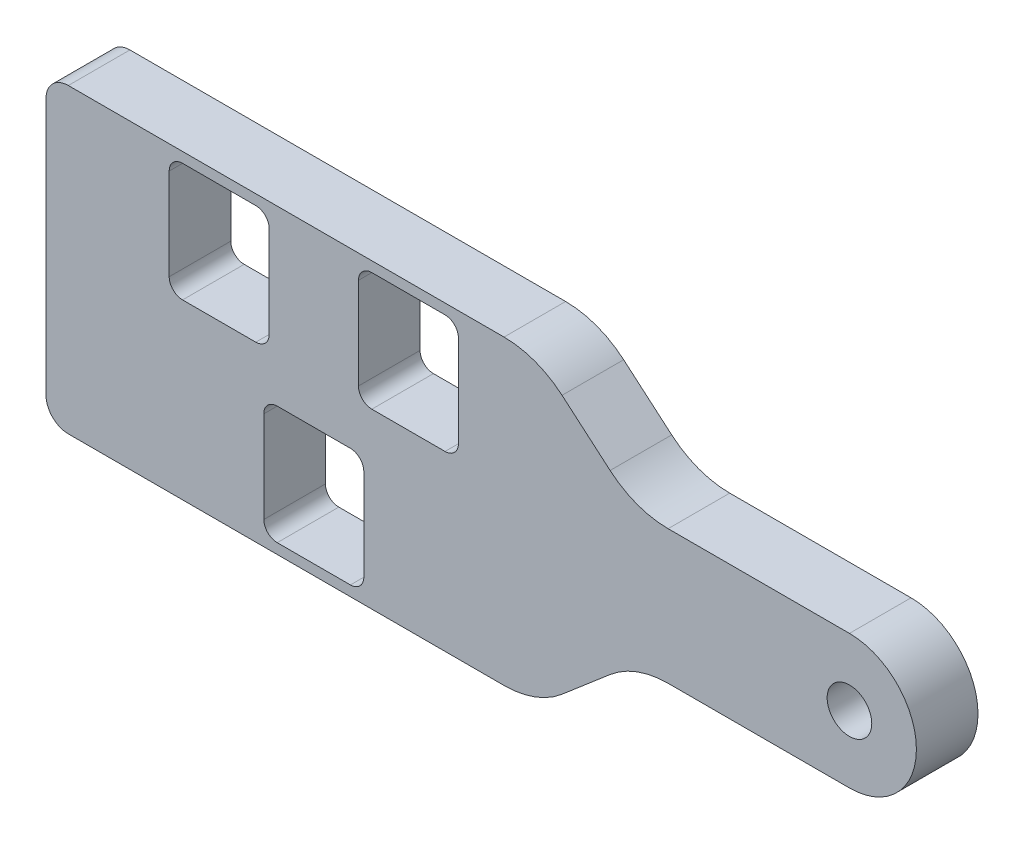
ISO-10303-21;
HEADER;
FILE_DESCRIPTION(('STEP AP214'),'2;1');
FILE_NAME('part.step','',(''),(''),'','','');
FILE_SCHEMA(('AUTOMOTIVE_DESIGN { 1 0 10303 214 1 1 1 1 }'));
ENDSEC;
DATA;
#1=APPLICATION_CONTEXT('core data for automotive mechanical design processes');
#2=APPLICATION_PROTOCOL_DEFINITION('international standard','automotive_design',2000,#1);
#3=PRODUCT_CONTEXT('',#1,'mechanical');
#4=PRODUCT('Part','Part','',(#3));
#5=PRODUCT_RELATED_PRODUCT_CATEGORY('part','',(#4));
#6=PRODUCT_DEFINITION_FORMATION('','',#4);
#7=PRODUCT_DEFINITION_CONTEXT('part definition',#1,'design');
#8=PRODUCT_DEFINITION('design','',#6,#7);
#9=PRODUCT_DEFINITION_SHAPE('','',#8);
#10=(LENGTH_UNIT() NAMED_UNIT(*) SI_UNIT(.MILLI.,.METRE.));
#11=(NAMED_UNIT(*) PLANE_ANGLE_UNIT() SI_UNIT($,.RADIAN.));
#12=(NAMED_UNIT(*) SI_UNIT($,.STERADIAN.) SOLID_ANGLE_UNIT());
#13=UNCERTAINTY_MEASURE_WITH_UNIT(LENGTH_MEASURE(1.E-05),#10,'distance_accuracy_value','');
#14=(GEOMETRIC_REPRESENTATION_CONTEXT(3) GLOBAL_UNCERTAINTY_ASSIGNED_CONTEXT((#13)) GLOBAL_UNIT_ASSIGNED_CONTEXT((#10,
#11,#12)) REPRESENTATION_CONTEXT('',''));
#15=CARTESIAN_POINT('',(0.,0.,0.));
#16=DIRECTION('',(0.,0.,1.));
#17=DIRECTION('',(1.,0.,0.));
#18=AXIS2_PLACEMENT_3D('',#15,#16,#17);
#19=CARTESIAN_POINT('',(88.502778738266,-0.762000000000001,8.763));
#20=DIRECTION('',(0.,0.,1.));
#21=DIRECTION('',(1.,0.,0.));
#22=AXIS2_PLACEMENT_3D('',#19,#20,#21);
#23=PLANE('',#22);
#24=CARTESIAN_POINT('',(19.431,39.5605000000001,8.763));
#25=DIRECTION('',(0.,0.,1.));
#26=DIRECTION('',(1.,0.,0.));
#27=AXIS2_PLACEMENT_3D('',#24,#25,#26);
#28=CIRCLE('',#27,1.905);
#29=CARTESIAN_POINT('',(19.431,41.4655000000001,8.763));
#30=VERTEX_POINT('',#29);
#31=CARTESIAN_POINT('',(17.526,39.5605000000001,8.763));
#32=VERTEX_POINT('',#31);
#33=EDGE_CURVE('E47',#30,#32,#28,.T.);
#34=ORIENTED_EDGE('',*,*,#33,.F.);
#35=DIRECTION('',(-1.,0.,0.));
#36=VECTOR('',#35,1.);
#37=CARTESIAN_POINT('',(29.845,41.4655000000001,8.763));
#38=LINE('',#37,#36);
#39=CARTESIAN_POINT('',(29.845,41.4655000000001,8.763));
#40=VERTEX_POINT('',#39);
#41=EDGE_CURVE('E296',#40,#30,#38,.T.);
#42=ORIENTED_EDGE('',*,*,#41,.F.);
#43=CARTESIAN_POINT('',(29.845,39.5605000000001,8.763));
#44=DIRECTION('',(0.,0.,1.));
#45=DIRECTION('',(-1.,0.,0.));
#46=AXIS2_PLACEMENT_3D('',#43,#44,#45);
#47=CIRCLE('',#46,1.905);
#48=CARTESIAN_POINT('',(31.75,39.5605000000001,8.763));
#49=VERTEX_POINT('',#48);
#50=EDGE_CURVE('E299',#49,#40,#47,.T.);
#51=ORIENTED_EDGE('',*,*,#50,.F.);
#52=DIRECTION('',(0.,1.,0.));
#53=VECTOR('',#52,1.);
#54=CARTESIAN_POINT('',(31.75,39.5605000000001,8.763));
#55=LINE('',#54,#53);
#56=CARTESIAN_POINT('',(31.75,26.543,8.763));
#57=VERTEX_POINT('',#56);
#58=EDGE_CURVE('E327',#57,#49,#55,.T.);
#59=ORIENTED_EDGE('',*,*,#58,.F.);
#60=CARTESIAN_POINT('',(29.845,26.543,8.763));
#61=DIRECTION('',(0.,0.,1.));
#62=DIRECTION('',(-1.,0.,0.));
#63=AXIS2_PLACEMENT_3D('',#60,#61,#62);
#64=CIRCLE('',#63,1.905);
#65=CARTESIAN_POINT('',(29.845,24.638,8.763));
#66=VERTEX_POINT('',#65);
#67=EDGE_CURVE('E324',#66,#57,#64,.T.);
#68=ORIENTED_EDGE('',*,*,#67,.F.);
#69=DIRECTION('',(1.,0.,0.));
#70=VECTOR('',#69,1.);
#71=CARTESIAN_POINT('',(29.845,24.638,8.763));
#72=LINE('',#71,#70);
#73=CARTESIAN_POINT('',(19.431,24.638,8.763));
#74=VERTEX_POINT('',#73);
#75=EDGE_CURVE('E321',#74,#66,#72,.T.);
#76=ORIENTED_EDGE('',*,*,#75,.F.);
#77=CARTESIAN_POINT('',(19.431,26.543,8.763));
#78=DIRECTION('',(0.,0.,1.));
#79=DIRECTION('',(-1.,0.,0.));
#80=AXIS2_PLACEMENT_3D('',#77,#78,#79);
#81=CIRCLE('',#80,1.905);
#82=CARTESIAN_POINT('',(17.526,26.543,8.763));
#83=VERTEX_POINT('',#82);
#84=EDGE_CURVE('E318',#83,#74,#81,.T.);
#85=ORIENTED_EDGE('',*,*,#84,.F.);
#86=DIRECTION('',(0.,-1.,0.));
#87=VECTOR('',#86,1.);
#88=CARTESIAN_POINT('',(17.526,39.5605000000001,8.763));
#89=LINE('',#88,#87);
#90=EDGE_CURVE('E316',#32,#83,#89,.T.);
#91=ORIENTED_EDGE('',*,*,#90,.F.);
#92=EDGE_LOOP('',(#34,#42,#51,#59,#68,#76,#85,#91));
#93=FACE_BOUND('',#92,.T.);
#94=CARTESIAN_POINT('',(46.355,39.5605000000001,8.763));
#95=DIRECTION('',(0.,0.,1.));
#96=DIRECTION('',(1.,0.,0.));
#97=AXIS2_PLACEMENT_3D('',#94,#95,#96);
#98=CIRCLE('',#97,1.905);
#99=CARTESIAN_POINT('',(46.355,41.4655000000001,8.763));
#100=VERTEX_POINT('',#99);
#101=CARTESIAN_POINT('',(44.45,39.5605000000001,8.763));
#102=VERTEX_POINT('',#101);
#103=EDGE_CURVE('E334',#100,#102,#98,.T.);
#104=ORIENTED_EDGE('',*,*,#103,.F.);
#105=DIRECTION('',(-1.,0.,0.));
#106=VECTOR('',#105,1.);
#107=CARTESIAN_POINT('',(46.355,41.4655000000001,8.763));
#108=LINE('',#107,#106);
#109=CARTESIAN_POINT('',(56.769,41.4655000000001,8.763));
#110=VERTEX_POINT('',#109);
#111=EDGE_CURVE('E350',#110,#100,#108,.T.);
#112=ORIENTED_EDGE('',*,*,#111,.F.);
#113=CARTESIAN_POINT('',(56.769,39.5605000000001,8.763));
#114=DIRECTION('',(0.,0.,1.));
#115=DIRECTION('',(-1.,0.,0.));
#116=AXIS2_PLACEMENT_3D('',#113,#114,#115);
#117=CIRCLE('',#116,1.905);
#118=CARTESIAN_POINT('',(58.674,39.5605000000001,8.763));
#119=VERTEX_POINT('',#118);
#120=EDGE_CURVE('E388',#119,#110,#117,.T.);
#121=ORIENTED_EDGE('',*,*,#120,.F.);
#122=DIRECTION('',(0.,1.,0.));
#123=VECTOR('',#122,1.);
#124=CARTESIAN_POINT('',(58.674,39.5605000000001,8.763));
#125=LINE('',#124,#123);
#126=CARTESIAN_POINT('',(58.674,26.543,8.763));
#127=VERTEX_POINT('',#126);
#128=EDGE_CURVE('E385',#127,#119,#125,.T.);
#129=ORIENTED_EDGE('',*,*,#128,.F.);
#130=CARTESIAN_POINT('',(56.769,26.543,8.763));
#131=DIRECTION('',(0.,0.,1.));
#132=DIRECTION('',(1.,0.,0.));
#133=AXIS2_PLACEMENT_3D('',#130,#131,#132);
#134=CIRCLE('',#133,1.905);
#135=CARTESIAN_POINT('',(56.769,24.638,8.763));
#136=VERTEX_POINT('',#135);
#137=EDGE_CURVE('E382',#136,#127,#134,.T.);
#138=ORIENTED_EDGE('',*,*,#137,.F.);
#139=DIRECTION('',(1.,0.,0.));
#140=VECTOR('',#139,1.);
#141=CARTESIAN_POINT('',(46.355,24.638,8.763));
#142=LINE('',#141,#140);
#143=CARTESIAN_POINT('',(46.355,24.638,8.763));
#144=VERTEX_POINT('',#143);
#145=EDGE_CURVE('E379',#144,#136,#142,.T.);
#146=ORIENTED_EDGE('',*,*,#145,.F.);
#147=CARTESIAN_POINT('',(46.355,26.543,8.763));
#148=DIRECTION('',(0.,0.,1.));
#149=DIRECTION('',(1.,0.,0.));
#150=AXIS2_PLACEMENT_3D('',#147,#148,#149);
#151=CIRCLE('',#150,1.905);
#152=CARTESIAN_POINT('',(44.45,26.543,8.763));
#153=VERTEX_POINT('',#152);
#154=EDGE_CURVE('E376',#153,#144,#151,.T.);
#155=ORIENTED_EDGE('',*,*,#154,.F.);
#156=DIRECTION('',(0.,-1.,0.));
#157=VECTOR('',#156,1.);
#158=CARTESIAN_POINT('',(44.45,39.5605000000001,8.763));
#159=LINE('',#158,#157);
#160=EDGE_CURVE('E373',#102,#153,#159,.T.);
#161=ORIENTED_EDGE('',*,*,#160,.F.);
#162=EDGE_LOOP('',(#104,#112,#121,#129,#138,#146,#155,#161));
#163=FACE_BOUND('',#162,.T.);
#164=CARTESIAN_POINT('',(32.8929999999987,16.383,8.763));
#165=DIRECTION('',(0.,0.,1.));
#166=DIRECTION('',(1.,0.,0.));
#167=AXIS2_PLACEMENT_3D('',#164,#165,#166);
#168=CIRCLE('',#167,1.905);
#169=CARTESIAN_POINT('',(32.8929999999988,18.288,8.763));
#170=VERTEX_POINT('',#169);
#171=CARTESIAN_POINT('',(30.9879999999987,16.383,8.763));
#172=VERTEX_POINT('',#171);
#173=EDGE_CURVE('E395',#170,#172,#168,.T.);
#174=ORIENTED_EDGE('',*,*,#173,.F.);
#175=DIRECTION('',(-1.,0.,0.));
#176=VECTOR('',#175,1.);
#177=CARTESIAN_POINT('',(32.8929999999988,18.288,8.763));
#178=LINE('',#177,#176);
#179=CARTESIAN_POINT('',(43.3070000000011,18.288,8.763));
#180=VERTEX_POINT('',#179);
#181=EDGE_CURVE('E414',#180,#170,#178,.T.);
#182=ORIENTED_EDGE('',*,*,#181,.F.);
#183=CARTESIAN_POINT('',(43.3070000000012,16.383,8.763));
#184=DIRECTION('',(0.,0.,1.));
#185=DIRECTION('',(-1.,0.,0.));
#186=AXIS2_PLACEMENT_3D('',#183,#184,#185);
#187=CIRCLE('',#186,1.905);
#188=CARTESIAN_POINT('',(45.2120000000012,16.383,8.763));
#189=VERTEX_POINT('',#188);
#190=EDGE_CURVE('E452',#189,#180,#187,.T.);
#191=ORIENTED_EDGE('',*,*,#190,.F.);
#192=DIRECTION('',(0.,1.,0.));
#193=VECTOR('',#192,1.);
#194=CARTESIAN_POINT('',(45.2120000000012,16.383,8.763));
#195=LINE('',#194,#193);
#196=CARTESIAN_POINT('',(45.2120000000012,3.36549999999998,8.763));
#197=VERTEX_POINT('',#196);
#198=EDGE_CURVE('E449',#197,#189,#195,.T.);
#199=ORIENTED_EDGE('',*,*,#198,.F.);
#200=CARTESIAN_POINT('',(43.3070000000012,3.36549999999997,8.763));
#201=DIRECTION('',(0.,0.,1.));
#202=DIRECTION('',(1.,0.,0.));
#203=AXIS2_PLACEMENT_3D('',#200,#201,#202);
#204=CIRCLE('',#203,1.905);
#205=CARTESIAN_POINT('',(43.3070000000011,1.46049999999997,8.763));
#206=VERTEX_POINT('',#205);
#207=EDGE_CURVE('E446',#206,#197,#204,.T.);
#208=ORIENTED_EDGE('',*,*,#207,.F.);
#209=DIRECTION('',(1.,0.,0.));
#210=VECTOR('',#209,1.);
#211=CARTESIAN_POINT('',(32.8929999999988,1.46049999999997,8.763));
#212=LINE('',#211,#210);
#213=CARTESIAN_POINT('',(32.8929999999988,1.46049999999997,8.763));
#214=VERTEX_POINT('',#213);
#215=EDGE_CURVE('E443',#214,#206,#212,.T.);
#216=ORIENTED_EDGE('',*,*,#215,.F.);
#217=CARTESIAN_POINT('',(32.8929999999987,3.36549999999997,8.763));
#218=DIRECTION('',(0.,0.,1.));
#219=DIRECTION('',(1.,0.,0.));
#220=AXIS2_PLACEMENT_3D('',#217,#218,#219);
#221=CIRCLE('',#220,1.905);
#222=CARTESIAN_POINT('',(30.9879999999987,3.36549999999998,8.763));
#223=VERTEX_POINT('',#222);
#224=EDGE_CURVE('E440',#223,#214,#221,.T.);
#225=ORIENTED_EDGE('',*,*,#224,.F.);
#226=DIRECTION('',(0.,-1.,0.));
#227=VECTOR('',#226,1.);
#228=CARTESIAN_POINT('',(30.9879999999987,16.383,8.763));
#229=LINE('',#228,#227);
#230=EDGE_CURVE('E437',#172,#223,#229,.T.);
#231=ORIENTED_EDGE('',*,*,#230,.F.);
#232=EDGE_LOOP('',(#174,#182,#191,#199,#208,#216,#225,#231));
#233=FACE_BOUND('',#232,.T.);
#234=CARTESIAN_POINT('',(88.502778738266,-0.762000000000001,8.763));
#235=DIRECTION('',(0.,0.,-1.));
#236=DIRECTION('',(1.,0.,0.));
#237=AXIS2_PLACEMENT_3D('',#234,#235,#236);
#238=CIRCLE('',#237,12.7);
#239=CARTESIAN_POINT('',(80.2501605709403,8.89120119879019,8.763));
#240=VERTEX_POINT('',#239);
#241=CARTESIAN_POINT('',(88.5027787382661,11.938,8.763));
#242=VERTEX_POINT('',#241);
#243=EDGE_CURVE('E480',#240,#242,#238,.T.);
#244=ORIENTED_EDGE('',*,*,#243,.T.);
#245=DIRECTION('',(1.,0.,0.));
#246=VECTOR('',#245,1.);
#247=CARTESIAN_POINT('',(114.3,11.938,8.763));
#248=LINE('',#247,#246);
#249=CARTESIAN_POINT('',(114.3,11.938,8.763));
#250=VERTEX_POINT('',#249);
#251=EDGE_CURVE('E483',#242,#250,#248,.T.);
#252=ORIENTED_EDGE('',*,*,#251,.T.);
#253=CARTESIAN_POINT('',(114.3,21.463,8.763));
#254=DIRECTION('',(0.,0.,1.));
#255=DIRECTION('',(1.,0.,0.));
#256=AXIS2_PLACEMENT_3D('',#253,#254,#255);
#257=CIRCLE('',#256,9.525);
#258=CARTESIAN_POINT('',(114.3,30.988,8.763));
#259=VERTEX_POINT('',#258);
#260=EDGE_CURVE('E486',#250,#259,#257,.T.);
#261=ORIENTED_EDGE('',*,*,#260,.T.);
#262=DIRECTION('',(-1.,0.,0.));
#263=VECTOR('',#262,1.);
#264=CARTESIAN_POINT('',(114.3,30.988,8.763));
#265=LINE('',#264,#263);
#266=CARTESIAN_POINT('',(88.5027787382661,30.988,8.763));
#267=VERTEX_POINT('',#266);
#268=EDGE_CURVE('E488',#259,#267,#265,.T.);
#269=ORIENTED_EDGE('',*,*,#268,.T.);
#270=CARTESIAN_POINT('',(88.502778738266,43.688,8.763));
#271=DIRECTION('',(0.,0.,-1.));
#272=DIRECTION('',(-1.,0.,0.));
#273=AXIS2_PLACEMENT_3D('',#270,#271,#272);
#274=CIRCLE('',#273,12.7);
#275=CARTESIAN_POINT('',(80.2501605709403,34.0347988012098,8.763));
#276=VERTEX_POINT('',#275);
#277=EDGE_CURVE('E490',#267,#276,#274,.T.);
#278=ORIENTED_EDGE('',*,*,#277,.T.);
#279=DIRECTION('',(-0.760094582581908,0.649812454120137,0.));
#280=VECTOR('',#279,1.);
#281=CARTESIAN_POINT('',(73.4138825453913,39.8792011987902,8.763));
#282=LINE('',#281,#280);
#283=CARTESIAN_POINT('',(73.4138825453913,39.8792011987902,8.763));
#284=VERTEX_POINT('',#283);
#285=EDGE_CURVE('E492',#276,#284,#282,.T.);
#286=ORIENTED_EDGE('',*,*,#285,.T.);
#287=CARTESIAN_POINT('',(65.1612643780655,30.226,8.763));
#288=DIRECTION('',(0.,0.,1.));
#289=DIRECTION('',(1.,0.,0.));
#290=AXIS2_PLACEMENT_3D('',#287,#288,#289);
#291=CIRCLE('',#290,12.7);
#292=CARTESIAN_POINT('',(65.1612643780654,42.926,8.763));
#293=VERTEX_POINT('',#292);
#294=EDGE_CURVE('E494',#284,#293,#291,.T.);
#295=ORIENTED_EDGE('',*,*,#294,.T.);
#296=DIRECTION('',(-1.,0.,0.));
#297=VECTOR('',#296,1.);
#298=CARTESIAN_POINT('',(3.17500000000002,42.926,8.763));
#299=LINE('',#298,#297);
#300=CARTESIAN_POINT('',(3.17500000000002,42.926,8.763));
#301=VERTEX_POINT('',#300);
#302=EDGE_CURVE('E496',#293,#301,#299,.T.);
#303=ORIENTED_EDGE('',*,*,#302,.T.);
#304=CARTESIAN_POINT('',(3.175,39.751,8.763));
#305=DIRECTION('',(0.,0.,1.));
#306=DIRECTION('',(1.,0.,0.));
#307=AXIS2_PLACEMENT_3D('',#304,#305,#306);
#308=CIRCLE('',#307,3.175);
#309=CARTESIAN_POINT('',(0.,39.751,8.763));
#310=VERTEX_POINT('',#309);
#311=EDGE_CURVE('E498',#301,#310,#308,.T.);
#312=ORIENTED_EDGE('',*,*,#311,.T.);
#313=DIRECTION('',(0.,-1.,0.));
#314=VECTOR('',#313,1.);
#315=CARTESIAN_POINT('',(0.,3.17500000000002,8.763));
#316=LINE('',#315,#314);
#317=CARTESIAN_POINT('',(0.,3.17500000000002,8.763));
#318=VERTEX_POINT('',#317);
#319=EDGE_CURVE('E500',#310,#318,#316,.T.);
#320=ORIENTED_EDGE('',*,*,#319,.T.);
#321=CARTESIAN_POINT('',(3.175,3.175,8.763));
#322=DIRECTION('',(0.,0.,1.));
#323=DIRECTION('',(1.,0.,0.));
#324=AXIS2_PLACEMENT_3D('',#321,#322,#323);
#325=CIRCLE('',#324,3.175);
#326=CARTESIAN_POINT('',(3.17500000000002,0.,8.763));
#327=VERTEX_POINT('',#326);
#328=EDGE_CURVE('E502',#318,#327,#325,.T.);
#329=ORIENTED_EDGE('',*,*,#328,.T.);
#330=DIRECTION('',(1.,0.,0.));
#331=VECTOR('',#330,1.);
#332=CARTESIAN_POINT('',(3.17500000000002,0.,8.763));
#333=LINE('',#332,#331);
#334=CARTESIAN_POINT('',(65.1612643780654,0.,8.763));
#335=VERTEX_POINT('',#334);
#336=EDGE_CURVE('E504',#327,#335,#333,.T.);
#337=ORIENTED_EDGE('',*,*,#336,.T.);
#338=CARTESIAN_POINT('',(65.1612643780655,12.7,8.763));
#339=DIRECTION('',(0.,0.,1.));
#340=DIRECTION('',(-1.,0.,0.));
#341=AXIS2_PLACEMENT_3D('',#338,#339,#340);
#342=CIRCLE('',#341,12.7);
#343=CARTESIAN_POINT('',(73.4138825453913,3.0467988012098,8.763));
#344=VERTEX_POINT('',#343);
#345=EDGE_CURVE('E506',#335,#344,#342,.T.);
#346=ORIENTED_EDGE('',*,*,#345,.T.);
#347=DIRECTION('',(0.760094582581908,0.649812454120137,0.));
#348=VECTOR('',#347,1.);
#349=CARTESIAN_POINT('',(80.2501605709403,8.89120119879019,8.763));
#350=LINE('',#349,#348);
#351=EDGE_CURVE('E508',#344,#240,#350,.T.);
#352=ORIENTED_EDGE('',*,*,#351,.T.);
#353=EDGE_LOOP('',(#244,#252,#261,#269,#278,#286,#295,#303,#312,#320,#329,#337,#346,#352));
#354=FACE_BOUND('',#353,.T.);
#355=CARTESIAN_POINT('',(114.3,21.463,8.763));
#356=DIRECTION('',(0.,0.,1.));
#357=DIRECTION('',(1.,0.,0.));
#358=AXIS2_PLACEMENT_3D('',#355,#356,#357);
#359=CIRCLE('',#358,3.175);
#360=CARTESIAN_POINT('',(117.475,21.463,8.763));
#361=VERTEX_POINT('',#360);
#362=EDGE_CURVE('E474',#361,#361,#359,.T.);
#363=ORIENTED_EDGE('',*,*,#362,.F.);
#364=EDGE_LOOP('',(#363));
#365=FACE_BOUND('',#364,.T.);
#366=ADVANCED_FACE('F32',(#93,#163,#233,#354,#365),#23,.T.);
#367=CARTESIAN_POINT('',(88.502778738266,-0.762000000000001,0.));
#368=DIRECTION('',(0.,0.,1.));
#369=DIRECTION('',(1.,0.,0.));
#370=AXIS2_PLACEMENT_3D('',#367,#368,#369);
#371=PLANE('',#370);
#372=DIRECTION('',(-1.,0.,0.));
#373=VECTOR('',#372,1.);
#374=CARTESIAN_POINT('',(29.845,41.4655000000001,0.));
#375=LINE('',#374,#373);
#376=CARTESIAN_POINT('',(29.845,41.4655000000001,0.));
#377=VERTEX_POINT('',#376);
#378=CARTESIAN_POINT('',(19.431,41.4655000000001,0.));
#379=VERTEX_POINT('',#378);
#380=EDGE_CURVE('E285',#377,#379,#375,.T.);
#381=ORIENTED_EDGE('',*,*,#380,.T.);
#382=CARTESIAN_POINT('',(19.431,39.5605000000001,0.));
#383=DIRECTION('',(0.,0.,1.));
#384=DIRECTION('',(1.,0.,0.));
#385=AXIS2_PLACEMENT_3D('',#382,#383,#384);
#386=CIRCLE('',#385,1.905);
#387=CARTESIAN_POINT('',(17.526,39.5605000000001,0.));
#388=VERTEX_POINT('',#387);
#389=EDGE_CURVE('E279',#379,#388,#386,.T.);
#390=ORIENTED_EDGE('',*,*,#389,.T.);
#391=DIRECTION('',(0.,-1.,0.));
#392=VECTOR('',#391,1.);
#393=CARTESIAN_POINT('',(17.526,39.5605000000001,0.));
#394=LINE('',#393,#392);
#395=CARTESIAN_POINT('',(17.526,26.543,0.));
#396=VERTEX_POINT('',#395);
#397=EDGE_CURVE('E288',#388,#396,#394,.T.);
#398=ORIENTED_EDGE('',*,*,#397,.T.);
#399=CARTESIAN_POINT('',(19.431,26.543,0.));
#400=DIRECTION('',(0.,0.,1.));
#401=DIRECTION('',(-1.,0.,0.));
#402=AXIS2_PLACEMENT_3D('',#399,#400,#401);
#403=CIRCLE('',#402,1.905);
#404=CARTESIAN_POINT('',(19.431,24.638,0.));
#405=VERTEX_POINT('',#404);
#406=EDGE_CURVE('E55',#396,#405,#403,.T.);
#407=ORIENTED_EDGE('',*,*,#406,.T.);
#408=DIRECTION('',(1.,0.,0.));
#409=VECTOR('',#408,1.);
#410=CARTESIAN_POINT('',(29.845,24.638,0.));
#411=LINE('',#410,#409);
#412=CARTESIAN_POINT('',(29.845,24.638,0.));
#413=VERTEX_POINT('',#412);
#414=EDGE_CURVE('E303',#405,#413,#411,.T.);
#415=ORIENTED_EDGE('',*,*,#414,.T.);
#416=CARTESIAN_POINT('',(29.845,26.543,0.));
#417=DIRECTION('',(0.,0.,1.));
#418=DIRECTION('',(-1.,0.,0.));
#419=AXIS2_PLACEMENT_3D('',#416,#417,#418);
#420=CIRCLE('',#419,1.905);
#421=CARTESIAN_POINT('',(31.75,26.543,0.));
#422=VERTEX_POINT('',#421);
#423=EDGE_CURVE('E306',#413,#422,#420,.T.);
#424=ORIENTED_EDGE('',*,*,#423,.T.);
#425=DIRECTION('',(0.,1.,0.));
#426=VECTOR('',#425,1.);
#427=CARTESIAN_POINT('',(31.75,39.5605000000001,0.));
#428=LINE('',#427,#426);
#429=CARTESIAN_POINT('',(31.75,39.5605000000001,0.));
#430=VERTEX_POINT('',#429);
#431=EDGE_CURVE('E309',#422,#430,#428,.T.);
#432=ORIENTED_EDGE('',*,*,#431,.T.);
#433=CARTESIAN_POINT('',(29.845,39.5605000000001,0.));
#434=DIRECTION('',(0.,0.,1.));
#435=DIRECTION('',(-1.,0.,0.));
#436=AXIS2_PLACEMENT_3D('',#433,#434,#435);
#437=CIRCLE('',#436,1.905);
#438=EDGE_CURVE('E312',#430,#377,#437,.T.);
#439=ORIENTED_EDGE('',*,*,#438,.T.);
#440=EDGE_LOOP('',(#381,#390,#398,#407,#415,#424,#432,#439));
#441=FACE_BOUND('',#440,.T.);
#442=DIRECTION('',(-1.,0.,0.));
#443=VECTOR('',#442,1.);
#444=CARTESIAN_POINT('',(46.355,41.4655000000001,0.));
#445=LINE('',#444,#443);
#446=CARTESIAN_POINT('',(56.769,41.4655000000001,0.));
#447=VERTEX_POINT('',#446);
#448=CARTESIAN_POINT('',(46.355,41.4655000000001,0.));
#449=VERTEX_POINT('',#448);
#450=EDGE_CURVE('E368',#447,#449,#445,.T.);
#451=ORIENTED_EDGE('',*,*,#450,.T.);
#452=CARTESIAN_POINT('',(46.355,39.5605000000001,0.));
#453=DIRECTION('',(0.,0.,1.));
#454=DIRECTION('',(1.,0.,0.));
#455=AXIS2_PLACEMENT_3D('',#452,#453,#454);
#456=CIRCLE('',#455,1.905);
#457=CARTESIAN_POINT('',(44.45,39.5605000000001,0.));
#458=VERTEX_POINT('',#457);
#459=EDGE_CURVE('E346',#449,#458,#456,.T.);
#460=ORIENTED_EDGE('',*,*,#459,.T.);
#461=DIRECTION('',(0.,-1.,0.));
#462=VECTOR('',#461,1.);
#463=CARTESIAN_POINT('',(44.45,39.5605000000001,0.));
#464=LINE('',#463,#462);
#465=CARTESIAN_POINT('',(44.45,26.543,0.));
#466=VERTEX_POINT('',#465);
#467=EDGE_CURVE('E349',#458,#466,#464,.T.);
#468=ORIENTED_EDGE('',*,*,#467,.T.);
#469=CARTESIAN_POINT('',(46.355,26.543,0.));
#470=DIRECTION('',(0.,0.,1.));
#471=DIRECTION('',(1.,0.,0.));
#472=AXIS2_PLACEMENT_3D('',#469,#470,#471);
#473=CIRCLE('',#472,1.905);
#474=CARTESIAN_POINT('',(46.355,24.638,0.));
#475=VERTEX_POINT('',#474);
#476=EDGE_CURVE('E353',#466,#475,#473,.T.);
#477=ORIENTED_EDGE('',*,*,#476,.T.);
#478=DIRECTION('',(1.,0.,0.));
#479=VECTOR('',#478,1.);
#480=CARTESIAN_POINT('',(46.355,24.638,0.));
#481=LINE('',#480,#479);
#482=CARTESIAN_POINT('',(56.769,24.638,0.));
#483=VERTEX_POINT('',#482);
#484=EDGE_CURVE('E356',#475,#483,#481,.T.);
#485=ORIENTED_EDGE('',*,*,#484,.T.);
#486=CARTESIAN_POINT('',(56.769,26.543,0.));
#487=DIRECTION('',(0.,0.,1.));
#488=DIRECTION('',(1.,0.,0.));
#489=AXIS2_PLACEMENT_3D('',#486,#487,#488);
#490=CIRCLE('',#489,1.905);
#491=CARTESIAN_POINT('',(58.674,26.543,0.));
#492=VERTEX_POINT('',#491);
#493=EDGE_CURVE('E359',#483,#492,#490,.T.);
#494=ORIENTED_EDGE('',*,*,#493,.T.);
#495=DIRECTION('',(0.,1.,0.));
#496=VECTOR('',#495,1.);
#497=CARTESIAN_POINT('',(58.674,39.5605000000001,0.));
#498=LINE('',#497,#496);
#499=CARTESIAN_POINT('',(58.674,39.5605000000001,0.));
#500=VERTEX_POINT('',#499);
#501=EDGE_CURVE('E362',#492,#500,#498,.T.);
#502=ORIENTED_EDGE('',*,*,#501,.T.);
#503=CARTESIAN_POINT('',(56.769,39.5605000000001,0.));
#504=DIRECTION('',(0.,0.,1.));
#505=DIRECTION('',(-1.,0.,0.));
#506=AXIS2_PLACEMENT_3D('',#503,#504,#505);
#507=CIRCLE('',#506,1.905);
#508=EDGE_CURVE('E365',#500,#447,#507,.T.);
#509=ORIENTED_EDGE('',*,*,#508,.T.);
#510=EDGE_LOOP('',(#451,#460,#468,#477,#485,#494,#502,#509));
#511=FACE_BOUND('',#510,.T.);
#512=DIRECTION('',(-1.,0.,0.));
#513=VECTOR('',#512,1.);
#514=CARTESIAN_POINT('',(32.8929999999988,18.288,0.));
#515=LINE('',#514,#513);
#516=CARTESIAN_POINT('',(43.3070000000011,18.288,0.));
#517=VERTEX_POINT('',#516);
#518=CARTESIAN_POINT('',(32.8929999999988,18.288,0.));
#519=VERTEX_POINT('',#518);
#520=EDGE_CURVE('E432',#517,#519,#515,.T.);
#521=ORIENTED_EDGE('',*,*,#520,.T.);
#522=CARTESIAN_POINT('',(32.8929999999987,16.383,0.));
#523=DIRECTION('',(0.,0.,1.));
#524=DIRECTION('',(1.,0.,0.));
#525=AXIS2_PLACEMENT_3D('',#522,#523,#524);
#526=CIRCLE('',#525,1.905);
#527=CARTESIAN_POINT('',(30.9879999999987,16.383,0.));
#528=VERTEX_POINT('',#527);
#529=EDGE_CURVE('E410',#519,#528,#526,.T.);
#530=ORIENTED_EDGE('',*,*,#529,.T.);
#531=DIRECTION('',(0.,-1.,0.));
#532=VECTOR('',#531,1.);
#533=CARTESIAN_POINT('',(30.9879999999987,16.383,0.));
#534=LINE('',#533,#532);
#535=CARTESIAN_POINT('',(30.9879999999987,3.36549999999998,0.));
#536=VERTEX_POINT('',#535);
#537=EDGE_CURVE('E413',#528,#536,#534,.T.);
#538=ORIENTED_EDGE('',*,*,#537,.T.);
#539=CARTESIAN_POINT('',(32.8929999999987,3.36549999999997,0.));
#540=DIRECTION('',(0.,0.,1.));
#541=DIRECTION('',(1.,0.,0.));
#542=AXIS2_PLACEMENT_3D('',#539,#540,#541);
#543=CIRCLE('',#542,1.905);
#544=CARTESIAN_POINT('',(32.8929999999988,1.46049999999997,0.));
#545=VERTEX_POINT('',#544);
#546=EDGE_CURVE('E417',#536,#545,#543,.T.);
#547=ORIENTED_EDGE('',*,*,#546,.T.);
#548=DIRECTION('',(1.,0.,0.));
#549=VECTOR('',#548,1.);
#550=CARTESIAN_POINT('',(32.8929999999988,1.46049999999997,0.));
#551=LINE('',#550,#549);
#552=CARTESIAN_POINT('',(43.3070000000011,1.46049999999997,0.));
#553=VERTEX_POINT('',#552);
#554=EDGE_CURVE('E420',#545,#553,#551,.T.);
#555=ORIENTED_EDGE('',*,*,#554,.T.);
#556=CARTESIAN_POINT('',(43.3070000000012,3.36549999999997,0.));
#557=DIRECTION('',(0.,0.,1.));
#558=DIRECTION('',(1.,0.,0.));
#559=AXIS2_PLACEMENT_3D('',#556,#557,#558);
#560=CIRCLE('',#559,1.905);
#561=CARTESIAN_POINT('',(45.2120000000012,3.36549999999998,0.));
#562=VERTEX_POINT('',#561);
#563=EDGE_CURVE('E423',#553,#562,#560,.T.);
#564=ORIENTED_EDGE('',*,*,#563,.T.);
#565=DIRECTION('',(0.,1.,0.));
#566=VECTOR('',#565,1.);
#567=CARTESIAN_POINT('',(45.2120000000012,16.383,0.));
#568=LINE('',#567,#566);
#569=CARTESIAN_POINT('',(45.2120000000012,16.383,0.));
#570=VERTEX_POINT('',#569);
#571=EDGE_CURVE('E426',#562,#570,#568,.T.);
#572=ORIENTED_EDGE('',*,*,#571,.T.);
#573=CARTESIAN_POINT('',(43.3070000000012,16.383,0.));
#574=DIRECTION('',(0.,0.,1.));
#575=DIRECTION('',(-1.,0.,0.));
#576=AXIS2_PLACEMENT_3D('',#573,#574,#575);
#577=CIRCLE('',#576,1.905);
#578=EDGE_CURVE('E429',#570,#517,#577,.T.);
#579=ORIENTED_EDGE('',*,*,#578,.T.);
#580=EDGE_LOOP('',(#521,#530,#538,#547,#555,#564,#572,#579));
#581=FACE_BOUND('',#580,.T.);
#582=CARTESIAN_POINT('',(88.502778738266,-0.762000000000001,0.));
#583=DIRECTION('',(0.,0.,-1.));
#584=DIRECTION('',(1.,0.,0.));
#585=AXIS2_PLACEMENT_3D('',#582,#583,#584);
#586=CIRCLE('',#585,12.7);
#587=CARTESIAN_POINT('',(80.2501605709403,8.89120119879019,0.));
#588=VERTEX_POINT('',#587);
#589=CARTESIAN_POINT('',(88.5027787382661,11.938,0.));
#590=VERTEX_POINT('',#589);
#591=EDGE_CURVE('E477',#588,#590,#586,.T.);
#592=ORIENTED_EDGE('',*,*,#591,.F.);
#593=DIRECTION('',(0.760094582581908,0.649812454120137,0.));
#594=VECTOR('',#593,1.);
#595=CARTESIAN_POINT('',(80.2501605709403,8.89120119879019,0.));
#596=LINE('',#595,#594);
#597=CARTESIAN_POINT('',(73.4138825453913,3.0467988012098,0.));
#598=VERTEX_POINT('',#597);
#599=EDGE_CURVE('E484',#598,#588,#596,.T.);
#600=ORIENTED_EDGE('',*,*,#599,.F.);
#601=CARTESIAN_POINT('',(65.1612643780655,12.7,0.));
#602=DIRECTION('',(0.,0.,1.));
#603=DIRECTION('',(-1.,0.,0.));
#604=AXIS2_PLACEMENT_3D('',#601,#602,#603);
#605=CIRCLE('',#604,12.7);
#606=CARTESIAN_POINT('',(65.1612643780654,0.,0.));
#607=VERTEX_POINT('',#606);
#608=EDGE_CURVE('E535',#607,#598,#605,.T.);
#609=ORIENTED_EDGE('',*,*,#608,.F.);
#610=DIRECTION('',(1.,0.,0.));
#611=VECTOR('',#610,1.);
#612=CARTESIAN_POINT('',(3.17500000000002,0.,0.));
#613=LINE('',#612,#611);
#614=CARTESIAN_POINT('',(3.17500000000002,0.,0.));
#615=VERTEX_POINT('',#614);
#616=EDGE_CURVE('E533',#615,#607,#613,.T.);
#617=ORIENTED_EDGE('',*,*,#616,.F.);
#618=CARTESIAN_POINT('',(3.175,3.175,0.));
#619=DIRECTION('',(0.,0.,1.));
#620=DIRECTION('',(1.,0.,0.));
#621=AXIS2_PLACEMENT_3D('',#618,#619,#620);
#622=CIRCLE('',#621,3.175);
#623=CARTESIAN_POINT('',(0.,3.17500000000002,0.));
#624=VERTEX_POINT('',#623);
#625=EDGE_CURVE('E531',#624,#615,#622,.T.);
#626=ORIENTED_EDGE('',*,*,#625,.F.);
#627=DIRECTION('',(0.,-1.,0.));
#628=VECTOR('',#627,1.);
#629=CARTESIAN_POINT('',(0.,3.17500000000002,0.));
#630=LINE('',#629,#628);
#631=CARTESIAN_POINT('',(0.,39.751,0.));
#632=VERTEX_POINT('',#631);
#633=EDGE_CURVE('E529',#632,#624,#630,.T.);
#634=ORIENTED_EDGE('',*,*,#633,.F.);
#635=CARTESIAN_POINT('',(3.175,39.751,0.));
#636=DIRECTION('',(0.,0.,1.));
#637=DIRECTION('',(1.,0.,0.));
#638=AXIS2_PLACEMENT_3D('',#635,#636,#637);
#639=CIRCLE('',#638,3.175);
#640=CARTESIAN_POINT('',(3.17500000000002,42.926,0.));
#641=VERTEX_POINT('',#640);
#642=EDGE_CURVE('E527',#641,#632,#639,.T.);
#643=ORIENTED_EDGE('',*,*,#642,.F.);
#644=DIRECTION('',(-1.,0.,0.));
#645=VECTOR('',#644,1.);
#646=CARTESIAN_POINT('',(3.17500000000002,42.926,0.));
#647=LINE('',#646,#645);
#648=CARTESIAN_POINT('',(65.1612643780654,42.926,0.));
#649=VERTEX_POINT('',#648);
#650=EDGE_CURVE('E525',#649,#641,#647,.T.);
#651=ORIENTED_EDGE('',*,*,#650,.F.);
#652=CARTESIAN_POINT('',(65.1612643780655,30.226,0.));
#653=DIRECTION('',(0.,0.,1.));
#654=DIRECTION('',(1.,0.,0.));
#655=AXIS2_PLACEMENT_3D('',#652,#653,#654);
#656=CIRCLE('',#655,12.7);
#657=CARTESIAN_POINT('',(73.4138825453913,39.8792011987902,0.));
#658=VERTEX_POINT('',#657);
#659=EDGE_CURVE('E523',#658,#649,#656,.T.);
#660=ORIENTED_EDGE('',*,*,#659,.F.);
#661=DIRECTION('',(-0.760094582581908,0.649812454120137,0.));
#662=VECTOR('',#661,1.);
#663=CARTESIAN_POINT('',(73.4138825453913,39.8792011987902,0.));
#664=LINE('',#663,#662);
#665=CARTESIAN_POINT('',(80.2501605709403,34.0347988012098,0.));
#666=VERTEX_POINT('',#665);
#667=EDGE_CURVE('E521',#666,#658,#664,.T.);
#668=ORIENTED_EDGE('',*,*,#667,.F.);
#669=CARTESIAN_POINT('',(88.502778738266,43.688,0.));
#670=DIRECTION('',(0.,0.,-1.));
#671=DIRECTION('',(-1.,0.,0.));
#672=AXIS2_PLACEMENT_3D('',#669,#670,#671);
#673=CIRCLE('',#672,12.7);
#674=CARTESIAN_POINT('',(88.5027787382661,30.988,0.));
#675=VERTEX_POINT('',#674);
#676=EDGE_CURVE('E519',#675,#666,#673,.T.);
#677=ORIENTED_EDGE('',*,*,#676,.F.);
#678=DIRECTION('',(-1.,0.,0.));
#679=VECTOR('',#678,1.);
#680=CARTESIAN_POINT('',(114.3,30.988,0.));
#681=LINE('',#680,#679);
#682=CARTESIAN_POINT('',(114.3,30.988,0.));
#683=VERTEX_POINT('',#682);
#684=EDGE_CURVE('E517',#683,#675,#681,.T.);
#685=ORIENTED_EDGE('',*,*,#684,.F.);
#686=CARTESIAN_POINT('',(114.3,21.463,0.));
#687=DIRECTION('',(0.,0.,1.));
#688=DIRECTION('',(1.,0.,0.));
#689=AXIS2_PLACEMENT_3D('',#686,#687,#688);
#690=CIRCLE('',#689,9.525);
#691=CARTESIAN_POINT('',(114.3,11.938,0.));
#692=VERTEX_POINT('',#691);
#693=EDGE_CURVE('E515',#692,#683,#690,.T.);
#694=ORIENTED_EDGE('',*,*,#693,.F.);
#695=DIRECTION('',(1.,0.,0.));
#696=VECTOR('',#695,1.);
#697=CARTESIAN_POINT('',(114.3,11.938,0.));
#698=LINE('',#697,#696);
#699=EDGE_CURVE('E513',#590,#692,#698,.T.);
#700=ORIENTED_EDGE('',*,*,#699,.F.);
#701=EDGE_LOOP('',(#592,#600,#609,#617,#626,#634,#643,#651,#660,#668,#677,#685,#694,#700));
#702=FACE_BOUND('',#701,.T.);
#703=CARTESIAN_POINT('',(114.3,21.463,0.));
#704=DIRECTION('',(0.,0.,1.));
#705=DIRECTION('',(1.,0.,0.));
#706=AXIS2_PLACEMENT_3D('',#703,#704,#705);
#707=CIRCLE('',#706,3.175);
#708=CARTESIAN_POINT('',(117.475,21.463,0.));
#709=VERTEX_POINT('',#708);
#710=EDGE_CURVE('E459',#709,#709,#707,.T.);
#711=ORIENTED_EDGE('',*,*,#710,.T.);
#712=EDGE_LOOP('',(#711));
#713=FACE_BOUND('',#712,.T.);
#714=ADVANCED_FACE('F292',(#441,#511,#581,#702,#713),#371,.F.);
#715=CARTESIAN_POINT('',(88.502778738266,-0.762000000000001,8.763));
#716=DIRECTION('',(0.,0.,-1.));
#717=DIRECTION('',(-1.,0.,0.));
#718=AXIS2_PLACEMENT_3D('',#715,#716,#717);
#719=CYLINDRICAL_SURFACE('',#718,12.7);
#720=ORIENTED_EDGE('',*,*,#591,.T.);
#721=DIRECTION('',(0.,0.,-1.));
#722=VECTOR('',#721,1.);
#723=CARTESIAN_POINT('',(88.5027787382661,11.938,8.763));
#724=LINE('',#723,#722);
#725=EDGE_CURVE('E11',#242,#590,#724,.T.);
#726=ORIENTED_EDGE('',*,*,#725,.F.);
#727=ORIENTED_EDGE('',*,*,#243,.F.);
#728=DIRECTION('',(0.,0.,-1.));
#729=VECTOR('',#728,1.);
#730=CARTESIAN_POINT('',(80.2501605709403,8.89120119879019,8.763));
#731=LINE('',#730,#729);
#732=EDGE_CURVE('E510',#240,#588,#731,.T.);
#733=ORIENTED_EDGE('',*,*,#732,.T.);
#734=EDGE_LOOP('',(#720,#726,#727,#733));
#735=FACE_BOUND('',#734,.T.);
#736=ADVANCED_FACE('F34',(#735),#719,.F.);
#737=CARTESIAN_POINT('',(114.3,11.938,8.763));
#738=DIRECTION('',(0.,1.,0.));
#739=DIRECTION('',(-1.,0.,0.));
#740=AXIS2_PLACEMENT_3D('',#737,#738,#739);
#741=PLANE('',#740);
#742=ORIENTED_EDGE('',*,*,#699,.T.);
#743=DIRECTION('',(0.,0.,-1.));
#744=VECTOR('',#743,1.);
#745=CARTESIAN_POINT('',(114.3,11.938,8.763));
#746=LINE('',#745,#744);
#747=EDGE_CURVE('E40',#250,#692,#746,.T.);
#748=ORIENTED_EDGE('',*,*,#747,.F.);
#749=ORIENTED_EDGE('',*,*,#251,.F.);
#750=ORIENTED_EDGE('',*,*,#725,.T.);
#751=EDGE_LOOP('',(#742,#748,#749,#750));
#752=FACE_BOUND('',#751,.T.);
#753=ADVANCED_FACE('F600',(#752),#741,.F.);
#754=CARTESIAN_POINT('',(114.3,21.463,8.763));
#755=DIRECTION('',(0.,0.,-1.));
#756=DIRECTION('',(-1.,0.,0.));
#757=AXIS2_PLACEMENT_3D('',#754,#755,#756);
#758=CYLINDRICAL_SURFACE('',#757,9.525);
#759=ORIENTED_EDGE('',*,*,#693,.T.);
#760=DIRECTION('',(0.,0.,-1.));
#761=VECTOR('',#760,1.);
#762=CARTESIAN_POINT('',(114.3,30.988,8.763));
#763=LINE('',#762,#761);
#764=EDGE_CURVE('E570',#259,#683,#763,.T.);
#765=ORIENTED_EDGE('',*,*,#764,.F.);
#766=ORIENTED_EDGE('',*,*,#260,.F.);
#767=ORIENTED_EDGE('',*,*,#747,.T.);
#768=EDGE_LOOP('',(#759,#765,#766,#767));
#769=FACE_BOUND('',#768,.T.);
#770=ADVANCED_FACE('F577',(#769),#758,.T.);
#771=CARTESIAN_POINT('',(114.3,30.988,8.763));
#772=DIRECTION('',(0.,-1.,0.));
#773=DIRECTION('',(1.,0.,0.));
#774=AXIS2_PLACEMENT_3D('',#771,#772,#773);
#775=PLANE('',#774);
#776=ORIENTED_EDGE('',*,*,#684,.T.);
#777=DIRECTION('',(0.,0.,-1.));
#778=VECTOR('',#777,1.);
#779=CARTESIAN_POINT('',(88.5027787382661,30.988,8.763));
#780=LINE('',#779,#778);
#781=EDGE_CURVE('E567',#267,#675,#780,.T.);
#782=ORIENTED_EDGE('',*,*,#781,.F.);
#783=ORIENTED_EDGE('',*,*,#268,.F.);
#784=ORIENTED_EDGE('',*,*,#764,.T.);
#785=EDGE_LOOP('',(#776,#782,#783,#784));
#786=FACE_BOUND('',#785,.T.);
#787=ADVANCED_FACE('F588',(#786),#775,.F.);
#788=CARTESIAN_POINT('',(88.502778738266,43.688,8.763));
#789=DIRECTION('',(0.,0.,-1.));
#790=DIRECTION('',(-1.,0.,0.));
#791=AXIS2_PLACEMENT_3D('',#788,#789,#790);
#792=CYLINDRICAL_SURFACE('',#791,12.7);
#793=ORIENTED_EDGE('',*,*,#676,.T.);
#794=DIRECTION('',(0.,0.,-1.));
#795=VECTOR('',#794,1.);
#796=CARTESIAN_POINT('',(80.2501605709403,34.0347988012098,8.763));
#797=LINE('',#796,#795);
#798=EDGE_CURVE('E564',#276,#666,#797,.T.);
#799=ORIENTED_EDGE('',*,*,#798,.F.);
#800=ORIENTED_EDGE('',*,*,#277,.F.);
#801=ORIENTED_EDGE('',*,*,#781,.T.);
#802=EDGE_LOOP('',(#793,#799,#800,#801));
#803=FACE_BOUND('',#802,.T.);
#804=ADVANCED_FACE('F592',(#803),#792,.F.);
#805=CARTESIAN_POINT('',(73.4138825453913,39.8792011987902,8.763));
#806=DIRECTION('',(-0.649812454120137,-0.760094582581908,0.));
#807=DIRECTION('',(0.760094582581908,-0.649812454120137,0.));
#808=AXIS2_PLACEMENT_3D('',#805,#806,#807);
#809=PLANE('',#808);
#810=ORIENTED_EDGE('',*,*,#667,.T.);
#811=DIRECTION('',(0.,0.,-1.));
#812=VECTOR('',#811,1.);
#813=CARTESIAN_POINT('',(73.4138825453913,39.8792011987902,8.763));
#814=LINE('',#813,#812);
#815=EDGE_CURVE('E561',#284,#658,#814,.T.);
#816=ORIENTED_EDGE('',*,*,#815,.F.);
#817=ORIENTED_EDGE('',*,*,#285,.F.);
#818=ORIENTED_EDGE('',*,*,#798,.T.);
#819=EDGE_LOOP('',(#810,#816,#817,#818));
#820=FACE_BOUND('',#819,.T.);
#821=ADVANCED_FACE('F643',(#820),#809,.F.);
#822=CARTESIAN_POINT('',(65.1612643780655,30.226,8.763));
#823=DIRECTION('',(0.,0.,-1.));
#824=DIRECTION('',(-1.,0.,0.));
#825=AXIS2_PLACEMENT_3D('',#822,#823,#824);
#826=CYLINDRICAL_SURFACE('',#825,12.7);
#827=ORIENTED_EDGE('',*,*,#659,.T.);
#828=DIRECTION('',(0.,0.,-1.));
#829=VECTOR('',#828,1.);
#830=CARTESIAN_POINT('',(65.1612643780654,42.926,8.763));
#831=LINE('',#830,#829);
#832=EDGE_CURVE('E558',#293,#649,#831,.T.);
#833=ORIENTED_EDGE('',*,*,#832,.F.);
#834=ORIENTED_EDGE('',*,*,#294,.F.);
#835=ORIENTED_EDGE('',*,*,#815,.T.);
#836=EDGE_LOOP('',(#827,#833,#834,#835));
#837=FACE_BOUND('',#836,.T.);
#838=ADVANCED_FACE('F641',(#837),#826,.T.);
#839=CARTESIAN_POINT('',(3.17500000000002,42.926,8.763));
#840=DIRECTION('',(0.,-1.,0.));
#841=DIRECTION('',(0.,0.,-1.));
#842=AXIS2_PLACEMENT_3D('',#839,#840,#841);
#843=PLANE('',#842);
#844=ORIENTED_EDGE('',*,*,#650,.T.);
#845=DIRECTION('',(0.,0.,-1.));
#846=VECTOR('',#845,1.);
#847=CARTESIAN_POINT('',(3.17500000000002,42.926,8.763));
#848=LINE('',#847,#846);
#849=EDGE_CURVE('E555',#301,#641,#848,.T.);
#850=ORIENTED_EDGE('',*,*,#849,.F.);
#851=ORIENTED_EDGE('',*,*,#302,.F.);
#852=ORIENTED_EDGE('',*,*,#832,.T.);
#853=EDGE_LOOP('',(#844,#850,#851,#852));
#854=FACE_BOUND('',#853,.T.);
#855=ADVANCED_FACE('F636',(#854),#843,.F.);
#856=CARTESIAN_POINT('',(3.175,39.751,8.763));
#857=DIRECTION('',(0.,0.,-1.));
#858=DIRECTION('',(-1.,0.,0.));
#859=AXIS2_PLACEMENT_3D('',#856,#857,#858);
#860=CYLINDRICAL_SURFACE('',#859,3.175);
#861=ORIENTED_EDGE('',*,*,#642,.T.);
#862=DIRECTION('',(0.,0.,-1.));
#863=VECTOR('',#862,1.);
#864=CARTESIAN_POINT('',(0.,39.751,8.763));
#865=LINE('',#864,#863);
#866=EDGE_CURVE('E552',#310,#632,#865,.T.);
#867=ORIENTED_EDGE('',*,*,#866,.F.);
#868=ORIENTED_EDGE('',*,*,#311,.F.);
#869=ORIENTED_EDGE('',*,*,#849,.T.);
#870=EDGE_LOOP('',(#861,#867,#868,#869));
#871=FACE_BOUND('',#870,.T.);
#872=ADVANCED_FACE('F631',(#871),#860,.T.);
#873=CARTESIAN_POINT('',(0.,3.17500000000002,8.763));
#874=DIRECTION('',(1.,0.,0.));
#875=DIRECTION('',(0.,0.,-1.));
#876=AXIS2_PLACEMENT_3D('',#873,#874,#875);
#877=PLANE('',#876);
#878=ORIENTED_EDGE('',*,*,#633,.T.);
#879=DIRECTION('',(0.,0.,-1.));
#880=VECTOR('',#879,1.);
#881=CARTESIAN_POINT('',(0.,3.17500000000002,8.763));
#882=LINE('',#881,#880);
#883=EDGE_CURVE('E549',#318,#624,#882,.T.);
#884=ORIENTED_EDGE('',*,*,#883,.F.);
#885=ORIENTED_EDGE('',*,*,#319,.F.);
#886=ORIENTED_EDGE('',*,*,#866,.T.);
#887=EDGE_LOOP('',(#878,#884,#885,#886));
#888=FACE_BOUND('',#887,.T.);
#889=ADVANCED_FACE('F627',(#888),#877,.F.);
#890=CARTESIAN_POINT('',(3.175,3.175,8.763));
#891=DIRECTION('',(0.,0.,-1.));
#892=DIRECTION('',(-1.,0.,0.));
#893=AXIS2_PLACEMENT_3D('',#890,#891,#892);
#894=CYLINDRICAL_SURFACE('',#893,3.175);
#895=ORIENTED_EDGE('',*,*,#625,.T.);
#896=DIRECTION('',(0.,0.,-1.));
#897=VECTOR('',#896,1.);
#898=CARTESIAN_POINT('',(3.17500000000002,0.,8.763));
#899=LINE('',#898,#897);
#900=EDGE_CURVE('E546',#327,#615,#899,.T.);
#901=ORIENTED_EDGE('',*,*,#900,.F.);
#902=ORIENTED_EDGE('',*,*,#328,.F.);
#903=ORIENTED_EDGE('',*,*,#883,.T.);
#904=EDGE_LOOP('',(#895,#901,#902,#903));
#905=FACE_BOUND('',#904,.T.);
#906=ADVANCED_FACE('F622',(#905),#894,.T.);
#907=CARTESIAN_POINT('',(3.17500000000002,0.,8.763));
#908=DIRECTION('',(0.,1.,0.));
#909=DIRECTION('',(0.,0.,1.));
#910=AXIS2_PLACEMENT_3D('',#907,#908,#909);
#911=PLANE('',#910);
#912=ORIENTED_EDGE('',*,*,#616,.T.);
#913=DIRECTION('',(0.,0.,-1.));
#914=VECTOR('',#913,1.);
#915=CARTESIAN_POINT('',(65.1612643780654,0.,8.763));
#916=LINE('',#915,#914);
#917=EDGE_CURVE('E543',#335,#607,#916,.T.);
#918=ORIENTED_EDGE('',*,*,#917,.F.);
#919=ORIENTED_EDGE('',*,*,#336,.F.);
#920=ORIENTED_EDGE('',*,*,#900,.T.);
#921=EDGE_LOOP('',(#912,#918,#919,#920));
#922=FACE_BOUND('',#921,.T.);
#923=ADVANCED_FACE('F616',(#922),#911,.F.);
#924=CARTESIAN_POINT('',(65.1612643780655,12.7,8.763));
#925=DIRECTION('',(0.,0.,-1.));
#926=DIRECTION('',(-1.,0.,0.));
#927=AXIS2_PLACEMENT_3D('',#924,#925,#926);
#928=CYLINDRICAL_SURFACE('',#927,12.7);
#929=ORIENTED_EDGE('',*,*,#608,.T.);
#930=DIRECTION('',(0.,0.,-1.));
#931=VECTOR('',#930,1.);
#932=CARTESIAN_POINT('',(73.4138825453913,3.0467988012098,8.763));
#933=LINE('',#932,#931);
#934=EDGE_CURVE('E540',#344,#598,#933,.T.);
#935=ORIENTED_EDGE('',*,*,#934,.F.);
#936=ORIENTED_EDGE('',*,*,#345,.F.);
#937=ORIENTED_EDGE('',*,*,#917,.T.);
#938=EDGE_LOOP('',(#929,#935,#936,#937));
#939=FACE_BOUND('',#938,.T.);
#940=ADVANCED_FACE('F612',(#939),#928,.T.);
#941=CARTESIAN_POINT('',(80.2501605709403,8.89120119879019,8.763));
#942=DIRECTION('',(-0.649812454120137,0.760094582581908,0.));
#943=DIRECTION('',(-0.760094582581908,-0.649812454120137,0.));
#944=AXIS2_PLACEMENT_3D('',#941,#942,#943);
#945=PLANE('',#944);
#946=ORIENTED_EDGE('',*,*,#599,.T.);
#947=ORIENTED_EDGE('',*,*,#732,.F.);
#948=ORIENTED_EDGE('',*,*,#351,.F.);
#949=ORIENTED_EDGE('',*,*,#934,.T.);
#950=EDGE_LOOP('',(#946,#947,#948,#949));
#951=FACE_BOUND('',#950,.T.);
#952=ADVANCED_FACE('F607',(#951),#945,.F.);
#953=CARTESIAN_POINT('',(114.3,21.463,8.763));
#954=DIRECTION('',(0.,0.,-1.));
#955=DIRECTION('',(-1.,0.,0.));
#956=AXIS2_PLACEMENT_3D('',#953,#954,#955);
#957=CYLINDRICAL_SURFACE('',#956,3.175);
#958=ORIENTED_EDGE('',*,*,#362,.T.);
#959=EDGE_LOOP('',(#958));
#960=FACE_BOUND('',#959,.T.);
#961=ORIENTED_EDGE('',*,*,#710,.F.);
#962=EDGE_LOOP('',(#961));
#963=FACE_BOUND('',#962,.T.);
#964=ADVANCED_FACE('F661',(#960,#963),#957,.F.);
#965=CARTESIAN_POINT('',(32.8929999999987,16.383,0.));
#966=DIRECTION('',(0.,0.,1.));
#967=DIRECTION('',(1.,0.,0.));
#968=AXIS2_PLACEMENT_3D('',#965,#966,#967);
#969=CYLINDRICAL_SURFACE('',#968,1.905);
#970=ORIENTED_EDGE('',*,*,#173,.T.);
#971=DIRECTION('',(0.,0.,1.));
#972=VECTOR('',#971,1.);
#973=CARTESIAN_POINT('',(30.9879999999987,16.383,0.));
#974=LINE('',#973,#972);
#975=EDGE_CURVE('E435',#528,#172,#974,.T.);
#976=ORIENTED_EDGE('',*,*,#975,.F.);
#977=ORIENTED_EDGE('',*,*,#529,.F.);
#978=DIRECTION('',(0.,0.,1.));
#979=VECTOR('',#978,1.);
#980=CARTESIAN_POINT('',(32.8929999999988,18.288,0.));
#981=LINE('',#980,#979);
#982=EDGE_CURVE('E457',#519,#170,#981,.T.);
#983=ORIENTED_EDGE('',*,*,#982,.T.);
#984=EDGE_LOOP('',(#970,#976,#977,#983));
#985=FACE_BOUND('',#984,.T.);
#986=ADVANCED_FACE('F711',(#985),#969,.F.);
#987=CARTESIAN_POINT('',(32.8929999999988,18.288,0.));
#988=DIRECTION('',(0.,1.,0.));
#989=DIRECTION('',(0.,0.,1.));
#990=AXIS2_PLACEMENT_3D('',#987,#988,#989);
#991=PLANE('',#990);
#992=ORIENTED_EDGE('',*,*,#181,.T.);
#993=ORIENTED_EDGE('',*,*,#982,.F.);
#994=ORIENTED_EDGE('',*,*,#520,.F.);
#995=DIRECTION('',(0.,0.,1.));
#996=VECTOR('',#995,1.);
#997=CARTESIAN_POINT('',(43.3070000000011,18.288,0.));
#998=LINE('',#997,#996);
#999=EDGE_CURVE('E460',#517,#180,#998,.T.);
#1000=ORIENTED_EDGE('',*,*,#999,.T.);
#1001=EDGE_LOOP('',(#992,#993,#994,#1000));
#1002=FACE_BOUND('',#1001,.T.);
#1003=ADVANCED_FACE('F718',(#1002),#991,.F.);
#1004=CARTESIAN_POINT('',(43.3070000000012,16.383,0.));
#1005=DIRECTION('',(0.,0.,1.));
#1006=DIRECTION('',(1.,0.,0.));
#1007=AXIS2_PLACEMENT_3D('',#1004,#1005,#1006);
#1008=CYLINDRICAL_SURFACE('',#1007,1.905);
#1009=ORIENTED_EDGE('',*,*,#190,.T.);
#1010=ORIENTED_EDGE('',*,*,#999,.F.);
#1011=ORIENTED_EDGE('',*,*,#578,.F.);
#1012=DIRECTION('',(0.,0.,1.));
#1013=VECTOR('',#1012,1.);
#1014=CARTESIAN_POINT('',(45.2120000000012,16.383,0.));
#1015=LINE('',#1014,#1013);
#1016=EDGE_CURVE('E462',#570,#189,#1015,.T.);
#1017=ORIENTED_EDGE('',*,*,#1016,.T.);
#1018=EDGE_LOOP('',(#1009,#1010,#1011,#1017));
#1019=FACE_BOUND('',#1018,.T.);
#1020=ADVANCED_FACE('F726',(#1019),#1008,.F.);
#1021=CARTESIAN_POINT('',(45.2120000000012,16.383,0.));
#1022=DIRECTION('',(1.,0.,0.));
#1023=DIRECTION('',(0.,0.,-1.));
#1024=AXIS2_PLACEMENT_3D('',#1021,#1022,#1023);
#1025=PLANE('',#1024);
#1026=ORIENTED_EDGE('',*,*,#198,.T.);
#1027=ORIENTED_EDGE('',*,*,#1016,.F.);
#1028=ORIENTED_EDGE('',*,*,#571,.F.);
#1029=DIRECTION('',(0.,0.,1.));
#1030=VECTOR('',#1029,1.);
#1031=CARTESIAN_POINT('',(45.2120000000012,3.36549999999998,0.));
#1032=LINE('',#1031,#1030);
#1033=EDGE_CURVE('E464',#562,#197,#1032,.T.);
#1034=ORIENTED_EDGE('',*,*,#1033,.T.);
#1035=EDGE_LOOP('',(#1026,#1027,#1028,#1034));
#1036=FACE_BOUND('',#1035,.T.);
#1037=ADVANCED_FACE('F734',(#1036),#1025,.F.);
#1038=CARTESIAN_POINT('',(43.3070000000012,3.36549999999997,0.));
#1039=DIRECTION('',(0.,0.,1.));
#1040=DIRECTION('',(1.,0.,0.));
#1041=AXIS2_PLACEMENT_3D('',#1038,#1039,#1040);
#1042=CYLINDRICAL_SURFACE('',#1041,1.905);
#1043=ORIENTED_EDGE('',*,*,#207,.T.);
#1044=ORIENTED_EDGE('',*,*,#1033,.F.);
#1045=ORIENTED_EDGE('',*,*,#563,.F.);
#1046=DIRECTION('',(0.,0.,1.));
#1047=VECTOR('',#1046,1.);
#1048=CARTESIAN_POINT('',(43.3070000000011,1.46049999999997,0.));
#1049=LINE('',#1048,#1047);
#1050=EDGE_CURVE('E466',#553,#206,#1049,.T.);
#1051=ORIENTED_EDGE('',*,*,#1050,.T.);
#1052=EDGE_LOOP('',(#1043,#1044,#1045,#1051));
#1053=FACE_BOUND('',#1052,.T.);
#1054=ADVANCED_FACE('F742',(#1053),#1042,.F.);
#1055=CARTESIAN_POINT('',(32.8929999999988,1.46049999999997,0.));
#1056=DIRECTION('',(0.,-1.,0.));
#1057=DIRECTION('',(0.,0.,-1.));
#1058=AXIS2_PLACEMENT_3D('',#1055,#1056,#1057);
#1059=PLANE('',#1058);
#1060=ORIENTED_EDGE('',*,*,#215,.T.);
#1061=ORIENTED_EDGE('',*,*,#1050,.F.);
#1062=ORIENTED_EDGE('',*,*,#554,.F.);
#1063=DIRECTION('',(0.,0.,1.));
#1064=VECTOR('',#1063,1.);
#1065=CARTESIAN_POINT('',(32.8929999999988,1.46049999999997,0.));
#1066=LINE('',#1065,#1064);
#1067=EDGE_CURVE('E468',#545,#214,#1066,.T.);
#1068=ORIENTED_EDGE('',*,*,#1067,.T.);
#1069=EDGE_LOOP('',(#1060,#1061,#1062,#1068));
#1070=FACE_BOUND('',#1069,.T.);
#1071=ADVANCED_FACE('F750',(#1070),#1059,.F.);
#1072=CARTESIAN_POINT('',(32.8929999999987,3.36549999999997,0.));
#1073=DIRECTION('',(0.,0.,1.));
#1074=DIRECTION('',(1.,0.,0.));
#1075=AXIS2_PLACEMENT_3D('',#1072,#1073,#1074);
#1076=CYLINDRICAL_SURFACE('',#1075,1.905);
#1077=ORIENTED_EDGE('',*,*,#224,.T.);
#1078=ORIENTED_EDGE('',*,*,#1067,.F.);
#1079=ORIENTED_EDGE('',*,*,#546,.F.);
#1080=DIRECTION('',(0.,0.,1.));
#1081=VECTOR('',#1080,1.);
#1082=CARTESIAN_POINT('',(30.9879999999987,3.36549999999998,0.));
#1083=LINE('',#1082,#1081);
#1084=EDGE_CURVE('E470',#536,#223,#1083,.T.);
#1085=ORIENTED_EDGE('',*,*,#1084,.T.);
#1086=EDGE_LOOP('',(#1077,#1078,#1079,#1085));
#1087=FACE_BOUND('',#1086,.T.);
#1088=ADVANCED_FACE('F758',(#1087),#1076,.F.);
#1089=CARTESIAN_POINT('',(30.9879999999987,16.383,0.));
#1090=DIRECTION('',(-1.,0.,0.));
#1091=DIRECTION('',(0.,0.,1.));
#1092=AXIS2_PLACEMENT_3D('',#1089,#1090,#1091);
#1093=PLANE('',#1092);
#1094=ORIENTED_EDGE('',*,*,#230,.T.);
#1095=ORIENTED_EDGE('',*,*,#1084,.F.);
#1096=ORIENTED_EDGE('',*,*,#537,.F.);
#1097=ORIENTED_EDGE('',*,*,#975,.T.);
#1098=EDGE_LOOP('',(#1094,#1095,#1096,#1097));
#1099=FACE_BOUND('',#1098,.T.);
#1100=ADVANCED_FACE('F766',(#1099),#1093,.F.);
#1101=CARTESIAN_POINT('',(46.355,39.5605000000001,0.));
#1102=DIRECTION('',(0.,0.,1.));
#1103=DIRECTION('',(1.,0.,0.));
#1104=AXIS2_PLACEMENT_3D('',#1101,#1102,#1103);
#1105=CYLINDRICAL_SURFACE('',#1104,1.905);
#1106=ORIENTED_EDGE('',*,*,#103,.T.);
#1107=DIRECTION('',(0.,0.,1.));
#1108=VECTOR('',#1107,1.);
#1109=CARTESIAN_POINT('',(44.45,39.5605000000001,0.));
#1110=LINE('',#1109,#1108);
#1111=EDGE_CURVE('E371',#458,#102,#1110,.T.);
#1112=ORIENTED_EDGE('',*,*,#1111,.F.);
#1113=ORIENTED_EDGE('',*,*,#459,.F.);
#1114=DIRECTION('',(0.,0.,1.));
#1115=VECTOR('',#1114,1.);
#1116=CARTESIAN_POINT('',(46.355,41.4655000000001,0.));
#1117=LINE('',#1116,#1115);
#1118=EDGE_CURVE('E393',#449,#100,#1117,.T.);
#1119=ORIENTED_EDGE('',*,*,#1118,.T.);
#1120=EDGE_LOOP('',(#1106,#1112,#1113,#1119));
#1121=FACE_BOUND('',#1120,.T.);
#1122=ADVANCED_FACE('F774',(#1121),#1105,.F.);
#1123=CARTESIAN_POINT('',(46.355,41.4655000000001,0.));
#1124=DIRECTION('',(0.,1.,0.));
#1125=DIRECTION('',(0.,0.,1.));
#1126=AXIS2_PLACEMENT_3D('',#1123,#1124,#1125);
#1127=PLANE('',#1126);
#1128=ORIENTED_EDGE('',*,*,#111,.T.);
#1129=ORIENTED_EDGE('',*,*,#1118,.F.);
#1130=ORIENTED_EDGE('',*,*,#450,.F.);
#1131=DIRECTION('',(0.,0.,1.));
#1132=VECTOR('',#1131,1.);
#1133=CARTESIAN_POINT('',(56.769,41.4655000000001,0.));
#1134=LINE('',#1133,#1132);
#1135=EDGE_CURVE('E396',#447,#110,#1134,.T.);
#1136=ORIENTED_EDGE('',*,*,#1135,.T.);
#1137=EDGE_LOOP('',(#1128,#1129,#1130,#1136));
#1138=FACE_BOUND('',#1137,.T.);
#1139=ADVANCED_FACE('F782',(#1138),#1127,.F.);
#1140=CARTESIAN_POINT('',(56.769,39.5605000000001,0.));
#1141=DIRECTION('',(0.,0.,1.));
#1142=DIRECTION('',(1.,0.,0.));
#1143=AXIS2_PLACEMENT_3D('',#1140,#1141,#1142);
#1144=CYLINDRICAL_SURFACE('',#1143,1.905);
#1145=ORIENTED_EDGE('',*,*,#120,.T.);
#1146=ORIENTED_EDGE('',*,*,#1135,.F.);
#1147=ORIENTED_EDGE('',*,*,#508,.F.);
#1148=DIRECTION('',(0.,0.,1.));
#1149=VECTOR('',#1148,1.);
#1150=CARTESIAN_POINT('',(58.674,39.5605000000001,0.));
#1151=LINE('',#1150,#1149);
#1152=EDGE_CURVE('E398',#500,#119,#1151,.T.);
#1153=ORIENTED_EDGE('',*,*,#1152,.T.);
#1154=EDGE_LOOP('',(#1145,#1146,#1147,#1153));
#1155=FACE_BOUND('',#1154,.T.);
#1156=ADVANCED_FACE('F790',(#1155),#1144,.F.);
#1157=CARTESIAN_POINT('',(58.674,39.5605000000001,0.));
#1158=DIRECTION('',(1.,0.,0.));
#1159=DIRECTION('',(0.,1.,0.));
#1160=AXIS2_PLACEMENT_3D('',#1157,#1158,#1159);
#1161=PLANE('',#1160);
#1162=ORIENTED_EDGE('',*,*,#128,.T.);
#1163=ORIENTED_EDGE('',*,*,#1152,.F.);
#1164=ORIENTED_EDGE('',*,*,#501,.F.);
#1165=DIRECTION('',(0.,0.,1.));
#1166=VECTOR('',#1165,1.);
#1167=CARTESIAN_POINT('',(58.674,26.543,0.));
#1168=LINE('',#1167,#1166);
#1169=EDGE_CURVE('E400',#492,#127,#1168,.T.);
#1170=ORIENTED_EDGE('',*,*,#1169,.T.);
#1171=EDGE_LOOP('',(#1162,#1163,#1164,#1170));
#1172=FACE_BOUND('',#1171,.T.);
#1173=ADVANCED_FACE('F798',(#1172),#1161,.F.);
#1174=CARTESIAN_POINT('',(56.769,26.543,0.));
#1175=DIRECTION('',(0.,0.,1.));
#1176=DIRECTION('',(1.,0.,0.));
#1177=AXIS2_PLACEMENT_3D('',#1174,#1175,#1176);
#1178=CYLINDRICAL_SURFACE('',#1177,1.905);
#1179=ORIENTED_EDGE('',*,*,#137,.T.);
#1180=ORIENTED_EDGE('',*,*,#1169,.F.);
#1181=ORIENTED_EDGE('',*,*,#493,.F.);
#1182=DIRECTION('',(0.,0.,1.));
#1183=VECTOR('',#1182,1.);
#1184=CARTESIAN_POINT('',(56.769,24.638,0.));
#1185=LINE('',#1184,#1183);
#1186=EDGE_CURVE('E402',#483,#136,#1185,.T.);
#1187=ORIENTED_EDGE('',*,*,#1186,.T.);
#1188=EDGE_LOOP('',(#1179,#1180,#1181,#1187));
#1189=FACE_BOUND('',#1188,.T.);
#1190=ADVANCED_FACE('F806',(#1189),#1178,.F.);
#1191=CARTESIAN_POINT('',(46.355,24.638,0.));
#1192=DIRECTION('',(0.,-1.,0.));
#1193=DIRECTION('',(0.,0.,-1.));
#1194=AXIS2_PLACEMENT_3D('',#1191,#1192,#1193);
#1195=PLANE('',#1194);
#1196=ORIENTED_EDGE('',*,*,#145,.T.);
#1197=ORIENTED_EDGE('',*,*,#1186,.F.);
#1198=ORIENTED_EDGE('',*,*,#484,.F.);
#1199=DIRECTION('',(0.,0.,1.));
#1200=VECTOR('',#1199,1.);
#1201=CARTESIAN_POINT('',(46.355,24.638,0.));
#1202=LINE('',#1201,#1200);
#1203=EDGE_CURVE('E404',#475,#144,#1202,.T.);
#1204=ORIENTED_EDGE('',*,*,#1203,.T.);
#1205=EDGE_LOOP('',(#1196,#1197,#1198,#1204));
#1206=FACE_BOUND('',#1205,.T.);
#1207=ADVANCED_FACE('F814',(#1206),#1195,.F.);
#1208=CARTESIAN_POINT('',(46.355,26.543,0.));
#1209=DIRECTION('',(0.,0.,1.));
#1210=DIRECTION('',(1.,0.,0.));
#1211=AXIS2_PLACEMENT_3D('',#1208,#1209,#1210);
#1212=CYLINDRICAL_SURFACE('',#1211,1.905);
#1213=ORIENTED_EDGE('',*,*,#154,.T.);
#1214=ORIENTED_EDGE('',*,*,#1203,.F.);
#1215=ORIENTED_EDGE('',*,*,#476,.F.);
#1216=DIRECTION('',(0.,0.,1.));
#1217=VECTOR('',#1216,1.);
#1218=CARTESIAN_POINT('',(44.45,26.543,0.));
#1219=LINE('',#1218,#1217);
#1220=EDGE_CURVE('E406',#466,#153,#1219,.T.);
#1221=ORIENTED_EDGE('',*,*,#1220,.T.);
#1222=EDGE_LOOP('',(#1213,#1214,#1215,#1221));
#1223=FACE_BOUND('',#1222,.T.);
#1224=ADVANCED_FACE('F822',(#1223),#1212,.F.);
#1225=CARTESIAN_POINT('',(44.45,39.5605000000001,0.));
#1226=DIRECTION('',(-1.,0.,0.));
#1227=DIRECTION('',(0.,-1.,0.));
#1228=AXIS2_PLACEMENT_3D('',#1225,#1226,#1227);
#1229=PLANE('',#1228);
#1230=ORIENTED_EDGE('',*,*,#160,.T.);
#1231=ORIENTED_EDGE('',*,*,#1220,.F.);
#1232=ORIENTED_EDGE('',*,*,#467,.F.);
#1233=ORIENTED_EDGE('',*,*,#1111,.T.);
#1234=EDGE_LOOP('',(#1230,#1231,#1232,#1233));
#1235=FACE_BOUND('',#1234,.T.);
#1236=ADVANCED_FACE('F830',(#1235),#1229,.F.);
#1237=CARTESIAN_POINT('',(19.431,39.5605000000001,0.));
#1238=DIRECTION('',(0.,0.,1.));
#1239=DIRECTION('',(1.,0.,0.));
#1240=AXIS2_PLACEMENT_3D('',#1237,#1238,#1239);
#1241=CYLINDRICAL_SURFACE('',#1240,1.905);
#1242=ORIENTED_EDGE('',*,*,#33,.T.);
#1243=DIRECTION('',(0.,0.,1.));
#1244=VECTOR('',#1243,1.);
#1245=CARTESIAN_POINT('',(17.526,39.5605000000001,0.));
#1246=LINE('',#1245,#1244);
#1247=EDGE_CURVE('E275',#388,#32,#1246,.T.);
#1248=ORIENTED_EDGE('',*,*,#1247,.F.);
#1249=ORIENTED_EDGE('',*,*,#389,.F.);
#1250=DIRECTION('',(0.,0.,1.));
#1251=VECTOR('',#1250,1.);
#1252=CARTESIAN_POINT('',(19.431,41.4655000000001,0.));
#1253=LINE('',#1252,#1251);
#1254=EDGE_CURVE('E332',#379,#30,#1253,.T.);
#1255=ORIENTED_EDGE('',*,*,#1254,.T.);
#1256=EDGE_LOOP('',(#1242,#1248,#1249,#1255));
#1257=FACE_BOUND('',#1256,.T.);
#1258=ADVANCED_FACE('F277',(#1257),#1241,.F.);
#1259=CARTESIAN_POINT('',(29.845,41.4655000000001,0.));
#1260=DIRECTION('',(0.,1.,0.));
#1261=DIRECTION('',(-1.,0.,0.));
#1262=AXIS2_PLACEMENT_3D('',#1259,#1260,#1261);
#1263=PLANE('',#1262);
#1264=ORIENTED_EDGE('',*,*,#41,.T.);
#1265=ORIENTED_EDGE('',*,*,#1254,.F.);
#1266=ORIENTED_EDGE('',*,*,#380,.F.);
#1267=DIRECTION('',(0.,0.,1.));
#1268=VECTOR('',#1267,1.);
#1269=CARTESIAN_POINT('',(29.845,41.4655000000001,0.));
#1270=LINE('',#1269,#1268);
#1271=EDGE_CURVE('E335',#377,#40,#1270,.T.);
#1272=ORIENTED_EDGE('',*,*,#1271,.T.);
#1273=EDGE_LOOP('',(#1264,#1265,#1266,#1272));
#1274=FACE_BOUND('',#1273,.T.);
#1275=ADVANCED_FACE('F845',(#1274),#1263,.F.);
#1276=CARTESIAN_POINT('',(29.845,39.5605000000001,0.));
#1277=DIRECTION('',(0.,0.,1.));
#1278=DIRECTION('',(1.,0.,0.));
#1279=AXIS2_PLACEMENT_3D('',#1276,#1277,#1278);
#1280=CYLINDRICAL_SURFACE('',#1279,1.905);
#1281=ORIENTED_EDGE('',*,*,#50,.T.);
#1282=ORIENTED_EDGE('',*,*,#1271,.F.);
#1283=ORIENTED_EDGE('',*,*,#438,.F.);
#1284=DIRECTION('',(0.,0.,1.));
#1285=VECTOR('',#1284,1.);
#1286=CARTESIAN_POINT('',(31.75,39.5605000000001,0.));
#1287=LINE('',#1286,#1285);
#1288=EDGE_CURVE('E337',#430,#49,#1287,.T.);
#1289=ORIENTED_EDGE('',*,*,#1288,.T.);
#1290=EDGE_LOOP('',(#1281,#1282,#1283,#1289));
#1291=FACE_BOUND('',#1290,.T.);
#1292=ADVANCED_FACE('F852',(#1291),#1280,.F.);
#1293=CARTESIAN_POINT('',(31.75,39.5605000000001,0.));
#1294=DIRECTION('',(1.,0.,0.));
#1295=DIRECTION('',(0.,1.,0.));
#1296=AXIS2_PLACEMENT_3D('',#1293,#1294,#1295);
#1297=PLANE('',#1296);
#1298=ORIENTED_EDGE('',*,*,#58,.T.);
#1299=ORIENTED_EDGE('',*,*,#1288,.F.);
#1300=ORIENTED_EDGE('',*,*,#431,.F.);
#1301=DIRECTION('',(0.,0.,1.));
#1302=VECTOR('',#1301,1.);
#1303=CARTESIAN_POINT('',(31.75,26.543,0.));
#1304=LINE('',#1303,#1302);
#1305=EDGE_CURVE('E339',#422,#57,#1304,.T.);
#1306=ORIENTED_EDGE('',*,*,#1305,.T.);
#1307=EDGE_LOOP('',(#1298,#1299,#1300,#1306));
#1308=FACE_BOUND('',#1307,.T.);
#1309=ADVANCED_FACE('F860',(#1308),#1297,.F.);
#1310=CARTESIAN_POINT('',(29.845,26.543,0.));
#1311=DIRECTION('',(0.,0.,1.));
#1312=DIRECTION('',(1.,0.,0.));
#1313=AXIS2_PLACEMENT_3D('',#1310,#1311,#1312);
#1314=CYLINDRICAL_SURFACE('',#1313,1.905);
#1315=ORIENTED_EDGE('',*,*,#67,.T.);
#1316=ORIENTED_EDGE('',*,*,#1305,.F.);
#1317=ORIENTED_EDGE('',*,*,#423,.F.);
#1318=DIRECTION('',(0.,0.,1.));
#1319=VECTOR('',#1318,1.);
#1320=CARTESIAN_POINT('',(29.845,24.638,0.));
#1321=LINE('',#1320,#1319);
#1322=EDGE_CURVE('E341',#413,#66,#1321,.T.);
#1323=ORIENTED_EDGE('',*,*,#1322,.T.);
#1324=EDGE_LOOP('',(#1315,#1316,#1317,#1323));
#1325=FACE_BOUND('',#1324,.T.);
#1326=ADVANCED_FACE('F868',(#1325),#1314,.F.);
#1327=CARTESIAN_POINT('',(29.845,24.638,0.));
#1328=DIRECTION('',(0.,-1.,0.));
#1329=DIRECTION('',(0.,0.,-1.));
#1330=AXIS2_PLACEMENT_3D('',#1327,#1328,#1329);
#1331=PLANE('',#1330);
#1332=ORIENTED_EDGE('',*,*,#75,.T.);
#1333=ORIENTED_EDGE('',*,*,#1322,.F.);
#1334=ORIENTED_EDGE('',*,*,#414,.F.);
#1335=DIRECTION('',(0.,0.,1.));
#1336=VECTOR('',#1335,1.);
#1337=CARTESIAN_POINT('',(19.431,24.638,0.));
#1338=LINE('',#1337,#1336);
#1339=EDGE_CURVE('E343',#405,#74,#1338,.T.);
#1340=ORIENTED_EDGE('',*,*,#1339,.T.);
#1341=EDGE_LOOP('',(#1332,#1333,#1334,#1340));
#1342=FACE_BOUND('',#1341,.T.);
#1343=ADVANCED_FACE('F876',(#1342),#1331,.F.);
#1344=CARTESIAN_POINT('',(19.431,26.543,0.));
#1345=DIRECTION('',(0.,0.,1.));
#1346=DIRECTION('',(1.,0.,0.));
#1347=AXIS2_PLACEMENT_3D('',#1344,#1345,#1346);
#1348=CYLINDRICAL_SURFACE('',#1347,1.905);
#1349=ORIENTED_EDGE('',*,*,#84,.T.);
#1350=ORIENTED_EDGE('',*,*,#1339,.F.);
#1351=ORIENTED_EDGE('',*,*,#406,.F.);
#1352=DIRECTION('',(0.,0.,1.));
#1353=VECTOR('',#1352,1.);
#1354=CARTESIAN_POINT('',(17.526,26.543,0.));
#1355=LINE('',#1354,#1353);
#1356=EDGE_CURVE('E284',#396,#83,#1355,.T.);
#1357=ORIENTED_EDGE('',*,*,#1356,.T.);
#1358=EDGE_LOOP('',(#1349,#1350,#1351,#1357));
#1359=FACE_BOUND('',#1358,.T.);
#1360=ADVANCED_FACE('F884',(#1359),#1348,.F.);
#1361=CARTESIAN_POINT('',(17.526,39.5605000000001,0.));
#1362=DIRECTION('',(-1.,0.,0.));
#1363=DIRECTION('',(0.,-1.,0.));
#1364=AXIS2_PLACEMENT_3D('',#1361,#1362,#1363);
#1365=PLANE('',#1364);
#1366=ORIENTED_EDGE('',*,*,#90,.T.);
#1367=ORIENTED_EDGE('',*,*,#1356,.F.);
#1368=ORIENTED_EDGE('',*,*,#397,.F.);
#1369=ORIENTED_EDGE('',*,*,#1247,.T.);
#1370=EDGE_LOOP('',(#1366,#1367,#1368,#1369));
#1371=FACE_BOUND('',#1370,.T.);
#1372=ADVANCED_FACE('F289',(#1371),#1365,.F.);
#1373=CLOSED_SHELL('',(#366,#714,#736,#753,#770,#787,#804,#821,#838,#855,#872,#889,#906,#923,
#940,#952,#964,#986,#1003,#1020,#1037,#1054,#1071,#1088,#1100,#1122,#1139,#1156,#1173,#1190,
#1207,#1224,#1236,#1258,#1275,#1292,#1309,#1326,#1343,#1360,#1372));
#1374=MANIFOLD_SOLID_BREP('B2',#1373);
#1375=ADVANCED_BREP_SHAPE_REPRESENTATION('',(#18,#1374),#14);
#1376=SHAPE_DEFINITION_REPRESENTATION(#9,#1375);
ENDSEC;
END-ISO-10303-21;
